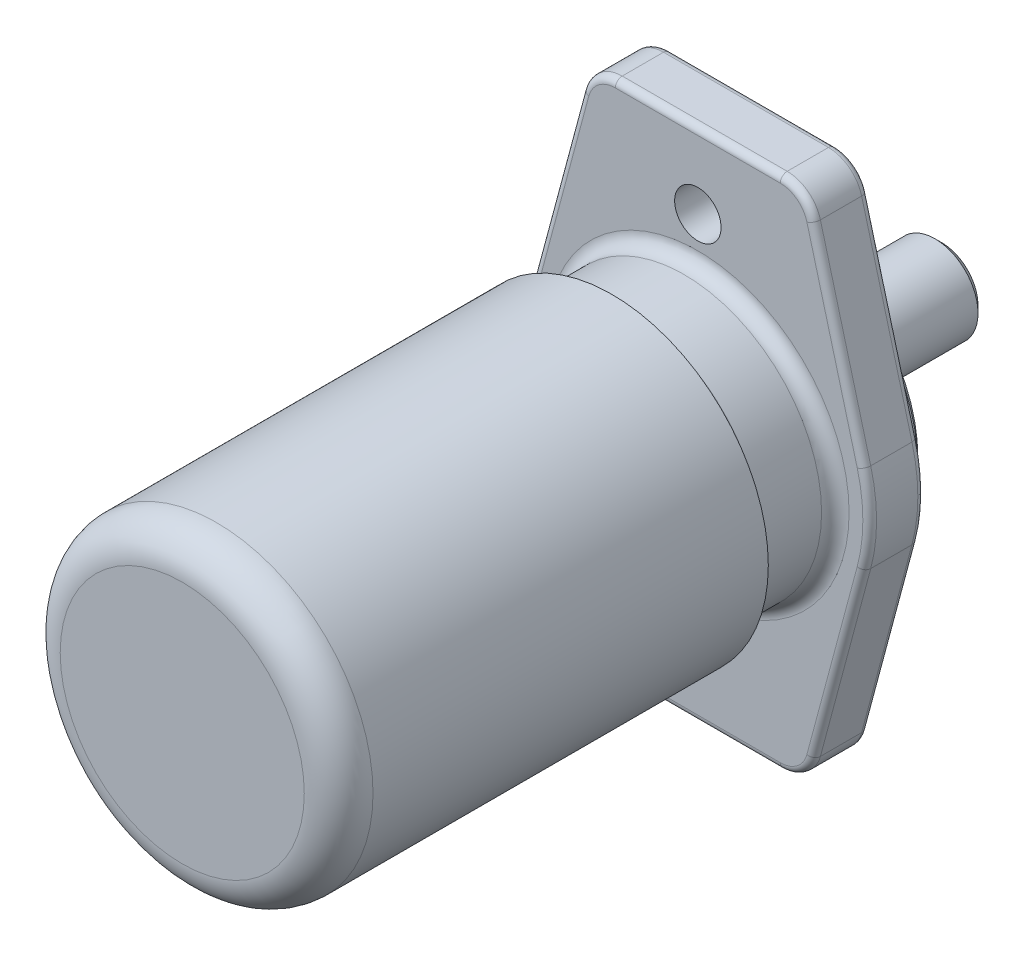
from build123d import *

# Parameters (mm, degrees)
ESQUISSE1_R          = 42
BASE_EXTRUSION_DEPTH = 8
ESQUISSE2_R          = 6.75
BOSS_EXTRU_1_DEPTH   = 16
ESQUISSE3_R          = 12.5
BOSS_EXTRU_2_DEPTH   = 47
ESQUISSE4_R          = 40
BOSS_EXTRU_3_DEPTH   = 25
ESQUISSE5_R          = 45.5
BOSS_EXTRU_4_DEPTH   = 125
CONG_1_R             = 10
CONG_2_R             = 4
CONG_3_R             = 2
CHANFREIN1_SIZE      = 2


with BuildPart() as part:
    # Esquisse1 → Base-Extrusion (new body)
    with BuildSketch(Plane.XY):
        Circle(ESQUISSE1_R)
    extrude(amount=BASE_EXTRUSION_DEPTH)

    # Esquisse2 → Boss.-Extru.1 (add)
    with BuildSketch(Plane.XY.offset(8)):
        with BuildLine():
            Line((-23.994349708, 75), (23.994349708, 75))
            ThreePointArc((23.994349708, 75), (30.081963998, 72.933533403), (33.653607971, 67.588190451))
            Line((33.653607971, 67.588190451), (48.296291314, 12.940952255))
            ThreePointArc((48.296291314, 12.940952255), (50, 0), (48.296291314, -12.940952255))
            Line((48.296291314, -12.940952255), (33.653607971, -67.588190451))
            ThreePointArc((33.653607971, -67.588190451), (30.081963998, -72.933533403), (23.994349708, -75))
            Line((23.994349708, -75), (-23.994349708, -75))
            ThreePointArc((-23.994349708, -75), (-30.081963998, -72.933533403), (-33.653607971, -67.588190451))
            Line((-33.653607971, -67.588190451), (-48.296291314, -12.940952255))
            ThreePointArc((-48.296291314, -12.940952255), (-50, 0), (-48.296291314, 12.940952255))
            Line((-48.296291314, 12.940952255), (-33.653607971, 67.588190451))
            ThreePointArc((-33.653607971, 67.588190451), (-30.081963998, 72.933533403), (-23.994349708, 75))
        make_face()
        with Locations((0, 53.2)):
            Circle(ESQUISSE2_R, mode=Mode.SUBTRACT)
        with Locations((0, -53.2)):
            Circle(ESQUISSE2_R, mode=Mode.SUBTRACT)
    extrude(amount=BOSS_EXTRU_1_DEPTH)

    # Esquisse3 → Boss.-Extru.2 (add)
    with BuildSketch(Plane(origin=(0, 0, 0), x_dir=(-1, 0, 0), z_dir=(0, 0, -1))):
        with Locations(Location((0, 0, 0), (0, 0, 180))):
            Circle(ESQUISSE3_R)
    extrude(amount=BOSS_EXTRU_2_DEPTH)

    # Esquisse4 → Boss.-Extru.3 (add)
    with BuildSketch(Plane.XY.offset(24)):
        Circle(ESQUISSE4_R)
    extrude(amount=BOSS_EXTRU_3_DEPTH)

    # Esquisse5 → Boss.-Extru.4 (add)
    with BuildSketch(Plane.XY.offset(49)):
        Circle(ESQUISSE5_R)
    extrude(amount=BOSS_EXTRU_4_DEPTH)

    # Cong_1
    cong_1_edges = [part.edges().sort_by_distance(p)[0] for p in [
        (-45.5, 0, 174),
    ]]
    fillet(cong_1_edges, radius=CONG_1_R)

    # Cong_2
    cong_2_edges = [part.edges().sort_by_distance(p)[0] for p in [
        (-40, 0, 49),
        (-40, 0, 24),
    ]]
    fillet(cong_2_edges, radius=CONG_2_R)

    # Cong_3
    cong_3_edges = [part.edges().sort_by_distance(p)[0] for p in [
        (-40.974949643, 40.264571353, 24),
        (-50, 0, 24),
        (-30.081963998, 72.933533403, 24),
        (-40.974949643, -40.264571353, 24),
        (0, 75, 24),
        (-30.081963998, -72.933533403, 24),
        (30.081963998, 72.933533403, 24),
        (0, -75, 24),
        (40.974949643, 40.264571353, 24),
        (30.081963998, -72.933533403, 24),
        (50, 0, 24),
        (40.974949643, -40.264571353, 24),
        (-40.974949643, 40.264571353, 8),
        (-50, 0, 8),
        (-30.081963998, 72.933533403, 8),
        (-40.974949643, -40.264571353, 8),
        (0, 75, 8),
        (-30.081963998, -72.933533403, 8),
        (30.081963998, 72.933533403, 8),
        (0, -75, 8),
        (40.974949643, 40.264571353, 8),
        (30.081963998, -72.933533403, 8),
        (50, 0, 8),
        (40.974949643, -40.264571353, 8),
    ]]
    fillet(cong_3_edges, radius=CONG_3_R)

    # Chanfrein1
    chanfrein1_edges = [part.edges().sort_by_distance(p)[0] for p in [
        (-42, 0, 0),
        (-12.5, 0, 0),
        (-12.5, 0, -47),
    ]]
    chamfer(chanfrein1_edges, length=CHANFREIN1_SIZE)


solid = part.part
